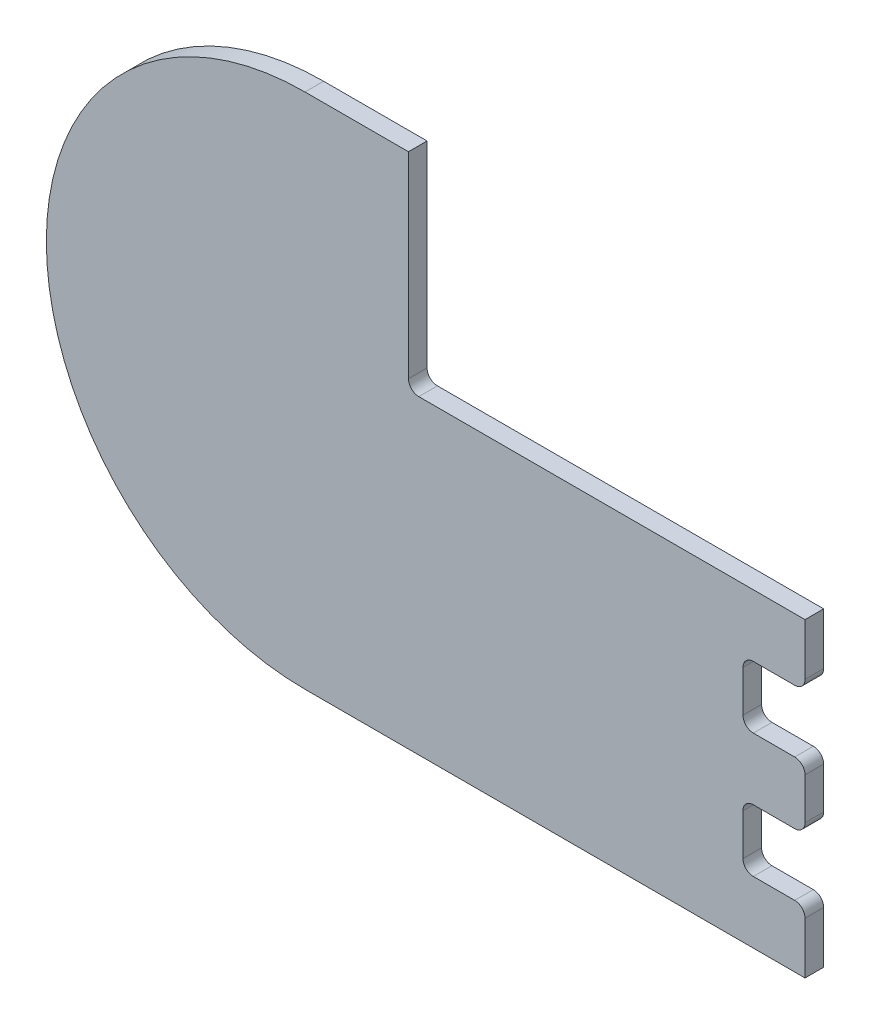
from build123d import *

# Parameters (mm, degrees)
BOSS_EXTRU_1_DEPTH           = 18
ENL_V_MAT_EXTRU_1_DEPTH      = 1129.195018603
ENL_V_MAT_EXTRU_1_DEPTH_BACK = 18
ENL_V_MAT_EXTRU_2_DEPTH      = 30
CONG_4_R                     = 10
CONG_5_R                     = 10
ENL_V_MAT_EXTRU_3_DEPTH      = 9
R_P_TITION_LIN_AIRE1_COUNT   = 3
R_P_TITION_LIN_AIRE1_PITCH   = 120


with BuildPart() as part:
    # Esquisse1 → Boss.-Extru.1 (new body)
    with BuildSketch(Plane.XY):
        with BuildLine():
            Line((-850, -250), (850, -250))
            ThreePointArc((850, -250), (1100, 0), (850, 250))
            Line((850, 250), (-850, 250))
            ThreePointArc((-850, 250), (-1100, 0), (-850, -250))
        make_face()
    extrude(amount=BOSS_EXTRU_1_DEPTH)

    # Esquisse2 → Enl_v. mat.-Extru.1 (cut, two sides: drawn at the far end of the back side and taken through both)
    with BuildSketch(Plane.XY.offset(18).offset(-ENL_V_MAT_EXTRU_1_DEPTH_BACK)):
        Polygon((-750, 4092.753579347), (-750, 250), (-750, 50), (750, 50), (750, 250), (750, 4092.753579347), (750, 11778.260738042), (-750, 11778.260738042), align=None)
    extrude(amount=ENL_V_MAT_EXTRU_1_DEPTH + ENL_V_MAT_EXTRU_1_DEPTH_BACK, mode=Mode.SUBTRACT)

    # Esquisse5 → Enl_v. mat.-Extru.2 (cut)
    with BuildSketch(Plane(origin=(0, 0, 0), x_dir=(-1, 0, 0), z_dir=(0, 0, -1))):
        Polygon((366.666666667, 50), (0, 50), (0, -250), (366.666666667, -250), (366.666666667, -190), (426.666666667, -190), (426.666666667, -130), (366.666666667, -130), (366.666666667, -70), (426.666666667, -70), (426.666666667, -10), (366.666666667, -10), align=None)
        Polygon((0, 50), (-366.666666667, 50), (-366.666666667, -10), (-426.666666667, -10), (-426.666666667, -70), (-366.666666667, -70), (-366.666666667, -130), (-426.666666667, -130), (-426.666666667, -190), (-366.666666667, -190), (-366.666666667, -250), (0, -250), align=None)
        with BuildLine():
            Line((-366.666666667, -10), (-366.666666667, 50))
            Line((-366.666666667, 50), (-750, 50))
            Line((-750, 50), (-750, 250))
            Line((-750, 250), (-850, 250))
            ThreePointArc((-850, 250), (-1100, 0), (-850, -250))
            Line((-850, -250), (-366.666666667, -250))
            Line((-366.666666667, -250), (-366.666666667, -190))
            Line((-366.666666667, -190), (-426.666666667, -190))
            Line((-426.666666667, -190), (-426.666666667, -130))
            Line((-426.666666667, -130), (-366.666666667, -130))
            Line((-366.666666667, -130), (-366.666666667, -70))
            Line((-366.666666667, -70), (-426.666666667, -70))
            Line((-426.666666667, -70), (-426.666666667, -10))
            Line((-426.666666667, -10), (-366.666666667, -10))
        make_face()
    extrude(amount=-ENL_V_MAT_EXTRU_2_DEPTH, mode=Mode.SUBTRACT)

    # Cong_4
    cong_4_edges = [part.edges().sort_by_distance(p)[0] for p in [
        (-366.666666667, -10, 9),
        (-426.666666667, -10, 9),
        (-426.666666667, -70, 9),
        (-366.666666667, -70, 9),
        (-366.666666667, -130, 9),
        (-426.666666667, -130, 9),
        (-426.666666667, -190, 9),
        (-366.666666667, -190, 9),
    ]]
    fillet(cong_4_edges, radius=CONG_4_R)

    # Cong_5
    cong_5_edges = [part.edges().sort_by_distance(p)[0] for p in [
        (-750, 50, 9),
    ]]
    fillet(cong_5_edges, radius=CONG_5_R)

    # Esquisse6 → Enl_v. mat.-Extru.3 (cut)
    with BuildSketch(Plane(origin=(0, 0, 0), x_dir=(-1, 0, 0), z_dir=(0, 0, -1))):
        with BuildLine():
            Line((391.909307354, 6), (401.42402598, 6))
            ThreePointArc((401.42402598, 6), (405.666666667, 6), (405.666666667, 10.242640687))
            Line((405.666666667, 10.242640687), (405.666666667, 29.757359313))
            ThreePointArc((405.666666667, 29.757359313), (405.666666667, 34), (401.42402598, 34))
            Line((401.42402598, 34), (391.909307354, 34))
            ThreePointArc((391.909307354, 34), (387.666666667, 34), (387.666666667, 29.757359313))
            Line((387.666666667, 29.757359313), (387.666666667, 10.242640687))
            ThreePointArc((387.666666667, 10.242640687), (387.666666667, 6), (391.909307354, 6))
        make_face()
    enl_v_mat_extru_3 = extrude(amount=-ENL_V_MAT_EXTRU_3_DEPTH, mode=Mode.SUBTRACT)

    # R_p_tition lin_aire1: Enl_v. mat.-Extru.3 ×3
    with Locations(*[(0, -i * R_P_TITION_LIN_AIRE1_PITCH, 0) for i in range(1, R_P_TITION_LIN_AIRE1_COUNT)]):
        add(enl_v_mat_extru_3, mode=Mode.SUBTRACT)


solid = part.part
